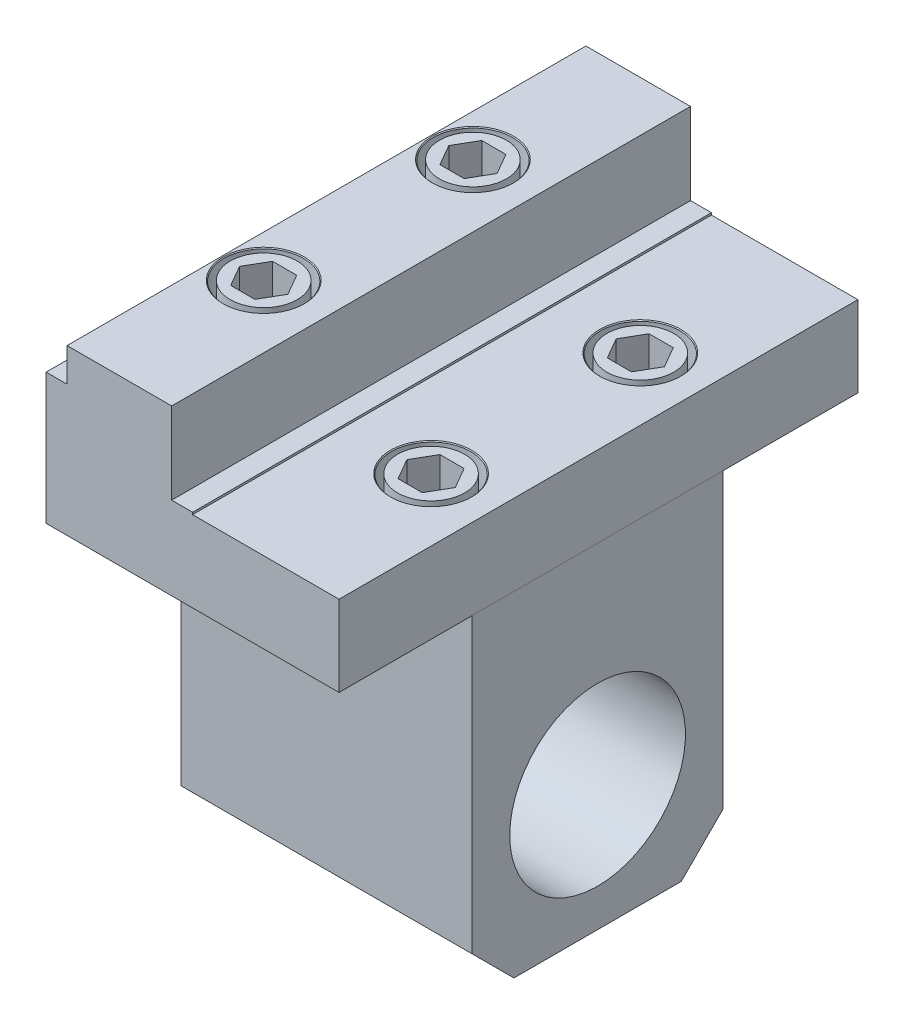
from build123d import *

# Parameters (mm, degrees)
BASIS_LINEAR_AUSTRAGEN_DEPTH         = 124
SCHNITT_LINEAR_AUSTRAGEN2_DEPTH      = 144.791515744
SCHNITT_LINEAR_AUSTRAGEN2_DEPTH_BACK = 144.791515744
SKIZZE2_R                            = 5.5
SKIZZE3_R                            = 9.5
SCHNITT_LINEAR_AUSTRAGEN3_DEPTH      = 10
SKIZZE5_R                            = 9.5
SCHNITT_LINEAR_AUSTRAGEN4_DEPTH      = 10
SKIZZE6_W                            = 35
SKIZZE6_H                            = 124
SCHNITT_LINEAR_AUSTRAGEN5_DEPTH      = 0.5
FASE10_SIZE                          = 0.2
SKIZZE7_W                            = 69.6
SKIZZE7_H                            = 60
AUFSATZ_LINEAR_AUSTRAGEN1_DEPTH      = 80
SKIZZE8_R                            = 21
SCHNITT_LINEAR_AUSTRAGEN6_DEPTH      = 164.242273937
FASE11_SIZE                          = 10
SKIZZE9_R                            = 8
AUFSATZ_LINEAR_AUSTRAGEN2_DEPTH      = 10
AUFSATZ_LINEAR_START                 = -1
SKIZZE9_2_R                          = 8
AUFSATZ_LINEAR_AUSTRAGEN3_DEPTH      = 1
SKIZZE11_R                           = 8
AUFSATZ_LINEAR_AUSTRAGEN4_DEPTH      = 9.5
AUFSATZ_LINEAR_START_2               = 1
SKIZZE11_3_R                         = 8
AUFSATZ_LINEAR_AUSTRAGEN5_DEPTH      = 1


with BuildPart() as part:
    # Skizze1 → Basis-Linear austragen (new body)
    with BuildSketch(Plane.XY):
        Polygon((0, 0), (0, 31.5), (5, 31.5), (5, 39.5), (30, 39.5), (30, 20), (70, 20), (70, 0), align=None)
    extrude(amount=-BASIS_LINEAR_AUSTRAGEN_DEPTH)

    # Skizze2 → Schnitt-Linear austragen2 (cut, two sides: drawn at the far end of the back side and taken through both)
    with BuildSketch(Plane(origin=(0, 20, 0), x_dir=(-1, 0, 0), z_dir=(0, 1, 0)).offset(-SCHNITT_LINEAR_AUSTRAGEN2_DEPTH_BACK)):
        with Locations(Location((-55, -87, 0), (0, 0, 90))):
            Circle(SKIZZE2_R)
        with Locations(Location((-55, -37, 0), (0, 0, 90))):
            Circle(SKIZZE2_R)
        with Locations(Location((-15, -87, 0), (0, 0, 90))):
            Circle(SKIZZE2_R)
        with Locations(Location((-15, -37, 0), (0, 0, 90))):
            Circle(SKIZZE2_R)
    extrude(amount=SCHNITT_LINEAR_AUSTRAGEN2_DEPTH + SCHNITT_LINEAR_AUSTRAGEN2_DEPTH_BACK, mode=Mode.SUBTRACT)

    # Skizze3 → Schnitt-Linear austragen3 (cut)
    with BuildSketch(Plane(origin=(0, 20, 0), x_dir=(-1, 0, 0), z_dir=(0, 1, 0))):
        with Locations(Location((-55, -87, 0), (0, 0, 90))):
            Circle(SKIZZE3_R)
        with Locations(Location((-55, -37, 0), (0, 0, 90))):
            Circle(SKIZZE3_R)
    extrude(amount=-SCHNITT_LINEAR_AUSTRAGEN3_DEPTH, mode=Mode.SUBTRACT)

    # Skizze5 → Schnitt-Linear austragen4 (cut)
    with BuildSketch(Plane(origin=(0, 39.5, 0), x_dir=(-1, 0, 0), z_dir=(0, 1, 0))):
        with Locations(Location((-15, -87, 0), (0, 0, 90))):
            Circle(SKIZZE5_R)
        with Locations(Location((-15, -37, 0), (0, 0, 90))):
            Circle(SKIZZE5_R)
    extrude(amount=-SCHNITT_LINEAR_AUSTRAGEN4_DEPTH, mode=Mode.SUBTRACT)

    # Skizze6 → Schnitt-Linear austragen5 (cut)
    with BuildSketch(Plane(origin=(0, 20, 0), x_dir=(-1, 0, 0), z_dir=(0, 1, 0))):
        with Locations((-52.5, -62)):
            Rectangle(SKIZZE6_W, SKIZZE6_H)
    extrude(amount=-SCHNITT_LINEAR_AUSTRAGEN5_DEPTH, mode=Mode.SUBTRACT)

    # Fase10
    fase10_edges = [part.edges().sort_by_distance(p)[0] for p in [
        (35, 0, 0),
        (0, 0, -62),
        (70, 0, -62),
        (55, 0, -92.5),
        (55, 0, -42.5),
        (15, 0, -92.5),
        (15, 0, -42.5),
        (35, 0, -124),
        (15, 39.5, -96.5),
        (15, 39.5, -46.5),
        (55, 19.5, -96.5),
        (55, 19.5, -46.5),
    ]]
    chamfer(fase10_edges, length=FASE10_SIZE)

    # Skizze9 → Aufsatz-Linear austragen2 (add)
    # profile 1 of 2: a face of its own
    with BuildSketch(Plane(origin=(0, 29.5, 0), x_dir=(1, 0, 0), z_dir=(0, 1, 0))):
        with Locations(Location((15, 37, 0), (0, 0, 270))):
            Circle(SKIZZE9_R)
        Polygon((12.113248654, 32), (17.886751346, 32), (20.773502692, 37), (17.886751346, 42), (12.113248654, 42), (9.226497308, 37), align=None, mode=Mode.SUBTRACT)
    # profile 2 of 2: a face of its own
    with BuildSketch(Plane(origin=(0, 29.5, 0), x_dir=(1, 0, 0), z_dir=(0, 1, 0))):
        with Locations(Location((15, 87, 0), (0, 0, 90))):
            Circle(SKIZZE9_R)
        Polygon((9.226497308, 87), (12.113248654, 92), (17.886751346, 92), (20.773502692, 87), (17.886751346, 82), (12.113248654, 82), align=None, mode=Mode.SUBTRACT)
    extrude(amount=AUFSATZ_LINEAR_AUSTRAGEN2_DEPTH)

    # Skizze9_2 → Aufsatz-Linear austragen3 (add)
    with BuildSketch(Plane(origin=(0, 29.5, 0), x_dir=(1, 0, 0), z_dir=(0, 1, 0)).offset(AUFSATZ_LINEAR_START)):
        with Locations(Location((15, 37, 0), (0, 0, 270))):
            Circle(SKIZZE9_2_R)
        with Locations(Location((15, 87, 0), (0, 0, 90))):
            Circle(SKIZZE9_2_R)
    extrude(amount=AUFSATZ_LINEAR_AUSTRAGEN3_DEPTH)

    # Skizze11 → Aufsatz-Linear austragen4 (add)
    # profile 1 of 2: a face of its own
    with BuildSketch(Plane(origin=(0, 10, -10), x_dir=(-1, 0, 0), z_dir=(0, -1, 0))):
        with Locations(Location((-55, 27, 0), (0, 0, 270))):
            Circle(SKIZZE11_R)
        Polygon((-57.886751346, 22), (-52.113248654, 22), (-49.226497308, 27), (-52.113248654, 32), (-57.886751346, 32), (-60.773502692, 27), align=None, mode=Mode.SUBTRACT)
    # profile 2 of 2: a face of its own
    with BuildSketch(Plane(origin=(0, 10, -10), x_dir=(-1, 0, 0), z_dir=(0, -1, 0))):
        with Locations(Location((-55, 77, 0), (0, 0, 270))):
            Circle(SKIZZE11_R)
        Polygon((-49.226497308, 77), (-52.113248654, 82), (-57.886751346, 82), (-60.773502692, 77), (-57.886751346, 72), (-52.113248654, 72), align=None, mode=Mode.SUBTRACT)
    extrude(amount=-AUFSATZ_LINEAR_AUSTRAGEN4_DEPTH)

    # Skizze11_3 → Aufsatz-Linear austragen5 (add)
    with BuildSketch(Plane(origin=(0, 10, -10), x_dir=(-1, 0, 0), z_dir=(0, -1, 0)).offset(AUFSATZ_LINEAR_START_2)):
        with Locations(Location((-55, 27, 0), (0, 0, 270))):
            Circle(SKIZZE11_3_R)
        with Locations(Location((-55, 77, 0), (0, 0, 270))):
            Circle(SKIZZE11_3_R)
    extrude(amount=-AUFSATZ_LINEAR_AUSTRAGEN5_DEPTH)


with BuildPart() as body_2:
    # Skizze7 → Aufsatz-Linear austragen1 (new body)
    with BuildSketch(Plane.XZ):
        with Locations((35, -62)):
            Rectangle(SKIZZE7_W, SKIZZE7_H)
    extrude(amount=AUFSATZ_LINEAR_AUSTRAGEN1_DEPTH)

    # Skizze8 → Schnitt-Linear austragen6 (cut, through all)
    with BuildSketch(Plane.ZY.offset(-0.2)):
        with Locations((-62, -50)):
            Circle(SKIZZE8_R)
    extrude(amount=-SCHNITT_LINEAR_AUSTRAGEN6_DEPTH, mode=Mode.SUBTRACT)

    # Fase11
    fase11_edges = [body_2.edges().sort_by_distance(p)[0] for p in [
        (35, -80, -92),
        (35, -80, -32),
    ]]
    chamfer(fase11_edges, length=FASE11_SIZE)


solid = Compound([part.part, body_2.part])
